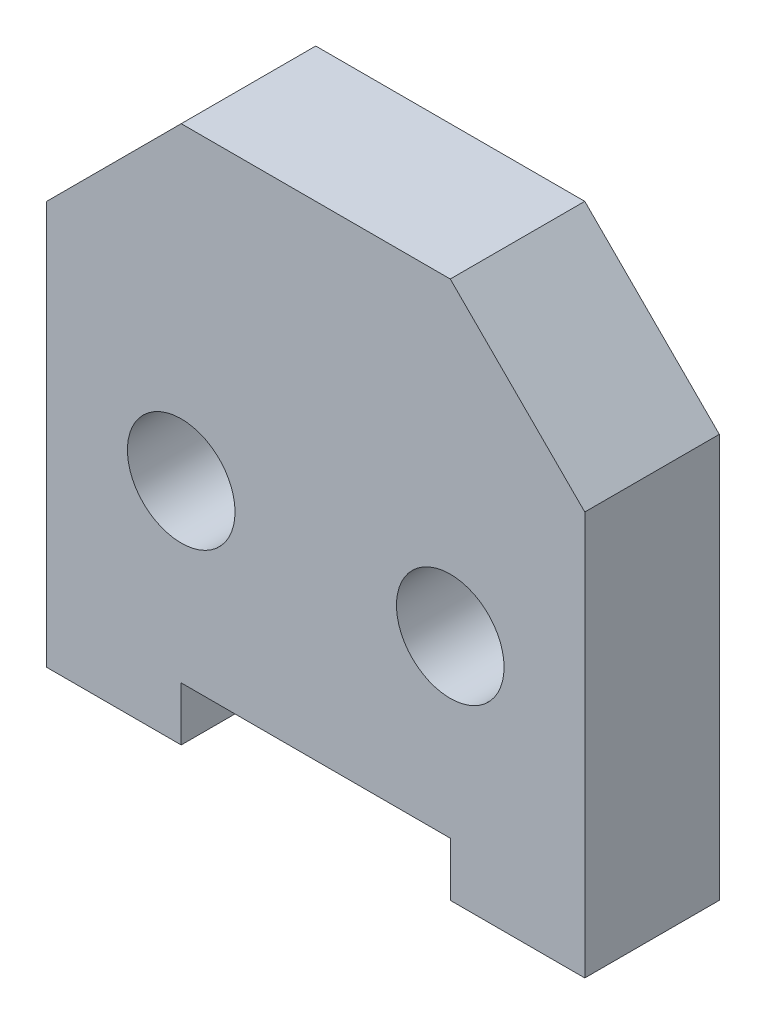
from build123d import *

# Parameters (mm, degrees)
ESQUISSE1_W             = 40
ESQUISSE1_H             = 40
BOSS_EXTRU_1_DEPTH      = 10
CHANFREIN1_SIZE         = 10
ESQUISSE2_R             = 4
ESQUISSE2_W             = 20
ESQUISSE2_H             = 4
ENL_V_MAT_EXTRU_1_DEPTH = 10


with BuildPart() as part:
    # Esquisse1 → Boss.-Extru.1 (new body)
    with BuildSketch(Plane.XY):
        with Locations((-20, 20)):
            Rectangle(ESQUISSE1_W, ESQUISSE1_H)
    extrude(amount=BOSS_EXTRU_1_DEPTH)

    # Chanfrein1
    chanfrein1_edges = [part.edges().sort_by_distance(p)[0] for p in [
        (-40, 40, 5),
        (0, 40, 5),
    ]]
    chamfer(chanfrein1_edges, length=CHANFREIN1_SIZE)

    # Esquisse2 → Enl_v. mat.-Extru.1 (cut)
    with BuildSketch(Plane.XY.offset(10)):
        with Locations((-30, 17)):
            Circle(ESQUISSE2_R)
        with Locations((-10, 17)):
            Circle(ESQUISSE2_R)
        with Locations((-20, 2)):
            Rectangle(ESQUISSE2_W, ESQUISSE2_H)
    extrude(amount=-ENL_V_MAT_EXTRU_1_DEPTH, mode=Mode.SUBTRACT)


solid = part.part
